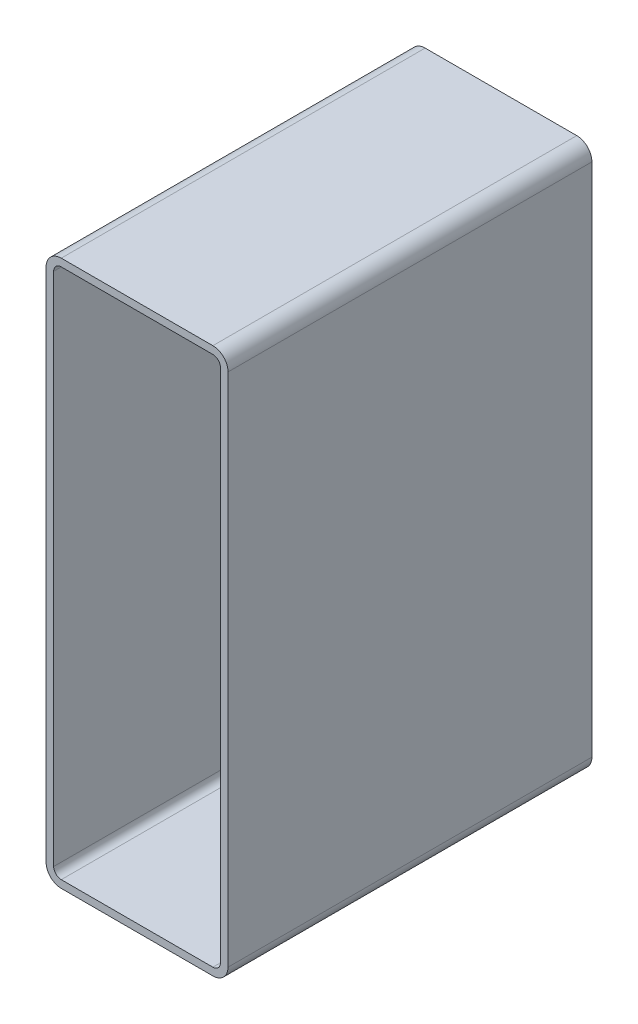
ISO-10303-21;
HEADER;
FILE_DESCRIPTION(('STEP AP214'),'2;1');
FILE_NAME('part.step','',(''),(''),'','','');
FILE_SCHEMA(('AUTOMOTIVE_DESIGN { 1 0 10303 214 1 1 1 1 }'));
ENDSEC;
DATA;
#1=APPLICATION_CONTEXT('core data for automotive mechanical design processes');
#2=APPLICATION_PROTOCOL_DEFINITION('international standard','automotive_design',2000,#1);
#3=PRODUCT_CONTEXT('',#1,'mechanical');
#4=PRODUCT('Part','Part','',(#3));
#5=PRODUCT_RELATED_PRODUCT_CATEGORY('part','',(#4));
#6=PRODUCT_DEFINITION_FORMATION('','',#4);
#7=PRODUCT_DEFINITION_CONTEXT('part definition',#1,'design');
#8=PRODUCT_DEFINITION('design','',#6,#7);
#9=PRODUCT_DEFINITION_SHAPE('','',#8);
#10=(LENGTH_UNIT() NAMED_UNIT(*) SI_UNIT(.MILLI.,.METRE.));
#11=(NAMED_UNIT(*) PLANE_ANGLE_UNIT() SI_UNIT($,.RADIAN.));
#12=(NAMED_UNIT(*) SI_UNIT($,.STERADIAN.) SOLID_ANGLE_UNIT());
#13=UNCERTAINTY_MEASURE_WITH_UNIT(LENGTH_MEASURE(1.E-05),#10,'distance_accuracy_value','');
#14=(GEOMETRIC_REPRESENTATION_CONTEXT(3) GLOBAL_UNCERTAINTY_ASSIGNED_CONTEXT((#13)) GLOBAL_UNIT_ASSIGNED_CONTEXT((#10,
#11,#12)) REPRESENTATION_CONTEXT('',''));
#15=CARTESIAN_POINT('',(0.,0.,0.));
#16=DIRECTION('',(0.,0.,1.));
#17=DIRECTION('',(1.,0.,0.));
#18=AXIS2_PLACEMENT_3D('',#15,#16,#17);
#19=CARTESIAN_POINT('',(139.747301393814,14.4370453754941,304.8));
#20=DIRECTION('',(0.,0.,1.));
#21=DIRECTION('',(1.,0.,0.));
#22=AXIS2_PLACEMENT_3D('',#19,#20,#21);
#23=PLANE('',#22);
#24=CARTESIAN_POINT('',(139.747301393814,14.4370453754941,304.8));
#25=DIRECTION('',(0.,0.,1.));
#26=DIRECTION('',(1.,0.,0.));
#27=AXIS2_PLACEMENT_3D('',#24,#25,#26);
#28=CIRCLE('',#27,12.7);
#29=CARTESIAN_POINT('',(139.747301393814,1.73704537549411,304.8));
#30=VERTEX_POINT('',#29);
#31=CARTESIAN_POINT('',(152.447301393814,14.4370453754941,304.8));
#32=VERTEX_POINT('',#31);
#33=EDGE_CURVE('E211',#30,#32,#28,.T.);
#34=ORIENTED_EDGE('',*,*,#33,.T.);
#35=DIRECTION('',(0.,1.,0.));
#36=VECTOR('',#35,1.);
#37=CARTESIAN_POINT('',(152.447301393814,446.237045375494,304.8));
#38=LINE('',#37,#36);
#39=CARTESIAN_POINT('',(152.447301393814,446.237045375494,304.8));
#40=VERTEX_POINT('',#39);
#41=EDGE_CURVE('E214',#32,#40,#38,.T.);
#42=ORIENTED_EDGE('',*,*,#41,.T.);
#43=CARTESIAN_POINT('',(139.747301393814,446.237045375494,304.8));
#44=DIRECTION('',(0.,0.,1.));
#45=DIRECTION('',(1.,0.,0.));
#46=AXIS2_PLACEMENT_3D('',#43,#44,#45);
#47=CIRCLE('',#46,12.7);
#48=CARTESIAN_POINT('',(139.747301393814,458.937045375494,304.8));
#49=VERTEX_POINT('',#48);
#50=EDGE_CURVE('E217',#40,#49,#47,.T.);
#51=ORIENTED_EDGE('',*,*,#50,.T.);
#52=DIRECTION('',(-1.,0.,0.));
#53=VECTOR('',#52,1.);
#54=CARTESIAN_POINT('',(12.7473013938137,458.937045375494,304.8));
#55=LINE('',#54,#53);
#56=CARTESIAN_POINT('',(12.7473013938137,458.937045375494,304.8));
#57=VERTEX_POINT('',#56);
#58=EDGE_CURVE('E219',#49,#57,#55,.T.);
#59=ORIENTED_EDGE('',*,*,#58,.T.);
#60=CARTESIAN_POINT('',(12.7473013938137,446.237045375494,304.8));
#61=DIRECTION('',(0.,0.,1.));
#62=DIRECTION('',(1.,0.,0.));
#63=AXIS2_PLACEMENT_3D('',#60,#61,#62);
#64=CIRCLE('',#63,12.7);
#65=CARTESIAN_POINT('',(0.0473013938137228,446.237045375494,304.8));
#66=VERTEX_POINT('',#65);
#67=EDGE_CURVE('E221',#57,#66,#64,.T.);
#68=ORIENTED_EDGE('',*,*,#67,.T.);
#69=DIRECTION('',(0.,-1.,0.));
#70=VECTOR('',#69,1.);
#71=CARTESIAN_POINT('',(0.0473013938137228,14.4370453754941,304.8));
#72=LINE('',#71,#70);
#73=CARTESIAN_POINT('',(0.0473013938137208,14.4370453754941,304.8));
#74=VERTEX_POINT('',#73);
#75=EDGE_CURVE('E223',#66,#74,#72,.T.);
#76=ORIENTED_EDGE('',*,*,#75,.T.);
#77=CARTESIAN_POINT('',(12.7473013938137,14.4370453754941,304.8));
#78=DIRECTION('',(0.,0.,1.));
#79=DIRECTION('',(1.,0.,0.));
#80=AXIS2_PLACEMENT_3D('',#77,#78,#79);
#81=CIRCLE('',#80,12.7);
#82=CARTESIAN_POINT('',(12.7473013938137,1.73704537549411,304.8));
#83=VERTEX_POINT('',#82);
#84=EDGE_CURVE('E225',#74,#83,#81,.T.);
#85=ORIENTED_EDGE('',*,*,#84,.T.);
#86=DIRECTION('',(1.,0.,0.));
#87=VECTOR('',#86,1.);
#88=CARTESIAN_POINT('',(139.747301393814,1.73704537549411,304.8));
#89=LINE('',#88,#87);
#90=EDGE_CURVE('E227',#83,#30,#89,.T.);
#91=ORIENTED_EDGE('',*,*,#90,.T.);
#92=EDGE_LOOP('',(#34,#42,#51,#59,#68,#76,#85,#91));
#93=FACE_BOUND('',#92,.T.);
#94=DIRECTION('',(0.,-1.,0.));
#95=VECTOR('',#94,1.);
#96=CARTESIAN_POINT('',(6.39730139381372,14.4370453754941,304.8));
#97=LINE('',#96,#95);
#98=CARTESIAN_POINT('',(6.39730139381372,446.237045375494,304.8));
#99=VERTEX_POINT('',#98);
#100=CARTESIAN_POINT('',(6.39730139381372,14.4370453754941,304.8));
#101=VERTEX_POINT('',#100);
#102=EDGE_CURVE('E154',#99,#101,#97,.T.);
#103=ORIENTED_EDGE('',*,*,#102,.F.);
#104=CARTESIAN_POINT('',(12.7473013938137,446.237045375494,304.8));
#105=DIRECTION('',(0.,0.,1.));
#106=DIRECTION('',(1.,0.,0.));
#107=AXIS2_PLACEMENT_3D('',#104,#105,#106);
#108=CIRCLE('',#107,6.35000000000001);
#109=CARTESIAN_POINT('',(12.7473013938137,452.587045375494,304.8));
#110=VERTEX_POINT('',#109);
#111=EDGE_CURVE('E146',#110,#99,#108,.T.);
#112=ORIENTED_EDGE('',*,*,#111,.F.);
#113=DIRECTION('',(-1.,0.,0.));
#114=VECTOR('',#113,1.);
#115=CARTESIAN_POINT('',(12.7473013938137,452.587045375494,304.8));
#116=LINE('',#115,#114);
#117=CARTESIAN_POINT('',(139.747301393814,452.587045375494,304.8));
#118=VERTEX_POINT('',#117);
#119=EDGE_CURVE('E179',#118,#110,#116,.T.);
#120=ORIENTED_EDGE('',*,*,#119,.F.);
#121=CARTESIAN_POINT('',(139.747301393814,446.237045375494,304.8));
#122=DIRECTION('',(0.,0.,1.));
#123=DIRECTION('',(1.,0.,0.));
#124=AXIS2_PLACEMENT_3D('',#121,#122,#123);
#125=CIRCLE('',#124,6.35000000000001);
#126=CARTESIAN_POINT('',(146.097301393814,446.237045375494,304.8));
#127=VERTEX_POINT('',#126);
#128=EDGE_CURVE('E177',#127,#118,#125,.T.);
#129=ORIENTED_EDGE('',*,*,#128,.F.);
#130=DIRECTION('',(0.,1.,0.));
#131=VECTOR('',#130,1.);
#132=CARTESIAN_POINT('',(146.097301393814,446.237045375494,304.8));
#133=LINE('',#132,#131);
#134=CARTESIAN_POINT('',(146.097301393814,14.4370453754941,304.8));
#135=VERTEX_POINT('',#134);
#136=EDGE_CURVE('E175',#135,#127,#133,.T.);
#137=ORIENTED_EDGE('',*,*,#136,.F.);
#138=CARTESIAN_POINT('',(139.747301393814,14.4370453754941,304.8));
#139=DIRECTION('',(0.,0.,1.));
#140=DIRECTION('',(1.,0.,0.));
#141=AXIS2_PLACEMENT_3D('',#138,#139,#140);
#142=CIRCLE('',#141,6.35);
#143=CARTESIAN_POINT('',(139.747301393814,8.08704537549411,304.8));
#144=VERTEX_POINT('',#143);
#145=EDGE_CURVE('E173',#144,#135,#142,.T.);
#146=ORIENTED_EDGE('',*,*,#145,.F.);
#147=DIRECTION('',(1.,0.,0.));
#148=VECTOR('',#147,1.);
#149=CARTESIAN_POINT('',(139.747301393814,8.0870453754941,304.8));
#150=LINE('',#149,#148);
#151=CARTESIAN_POINT('',(12.7473013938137,8.0870453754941,304.8));
#152=VERTEX_POINT('',#151);
#153=EDGE_CURVE('E169',#152,#144,#150,.T.);
#154=ORIENTED_EDGE('',*,*,#153,.F.);
#155=CARTESIAN_POINT('',(12.7473013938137,14.4370453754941,304.8));
#156=DIRECTION('',(0.,0.,1.));
#157=DIRECTION('',(1.,0.,0.));
#158=AXIS2_PLACEMENT_3D('',#155,#156,#157);
#159=CIRCLE('',#158,6.35);
#160=EDGE_CURVE('E167',#101,#152,#159,.T.);
#161=ORIENTED_EDGE('',*,*,#160,.F.);
#162=EDGE_LOOP('',(#103,#112,#120,#129,#137,#146,#154,#161));
#163=FACE_BOUND('',#162,.T.);
#164=ADVANCED_FACE('F33',(#93,#163),#23,.T.);
#165=CARTESIAN_POINT('',(139.747301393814,14.4370453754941,0.));
#166=DIRECTION('',(0.,0.,1.));
#167=DIRECTION('',(1.,0.,0.));
#168=AXIS2_PLACEMENT_3D('',#165,#166,#167);
#169=PLANE('',#168);
#170=CARTESIAN_POINT('',(139.747301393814,14.4370453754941,0.));
#171=DIRECTION('',(0.,0.,1.));
#172=DIRECTION('',(1.,0.,0.));
#173=AXIS2_PLACEMENT_3D('',#170,#171,#172);
#174=CIRCLE('',#173,12.7);
#175=CARTESIAN_POINT('',(139.747301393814,1.73704537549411,0.));
#176=VERTEX_POINT('',#175);
#177=CARTESIAN_POINT('',(152.447301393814,14.4370453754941,0.));
#178=VERTEX_POINT('',#177);
#179=EDGE_CURVE('E162',#176,#178,#174,.T.);
#180=ORIENTED_EDGE('',*,*,#179,.F.);
#181=DIRECTION('',(1.,0.,0.));
#182=VECTOR('',#181,1.);
#183=CARTESIAN_POINT('',(139.747301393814,1.73704537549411,0.));
#184=LINE('',#183,#182);
#185=CARTESIAN_POINT('',(12.7473013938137,1.73704537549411,0.));
#186=VERTEX_POINT('',#185);
#187=EDGE_CURVE('E215',#186,#176,#184,.T.);
#188=ORIENTED_EDGE('',*,*,#187,.F.);
#189=CARTESIAN_POINT('',(12.7473013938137,14.4370453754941,0.));
#190=DIRECTION('',(0.,0.,1.));
#191=DIRECTION('',(1.,0.,0.));
#192=AXIS2_PLACEMENT_3D('',#189,#190,#191);
#193=CIRCLE('',#192,12.7);
#194=CARTESIAN_POINT('',(0.0473013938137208,14.4370453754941,0.));
#195=VERTEX_POINT('',#194);
#196=EDGE_CURVE('E242',#195,#186,#193,.T.);
#197=ORIENTED_EDGE('',*,*,#196,.F.);
#198=DIRECTION('',(0.,-1.,0.));
#199=VECTOR('',#198,1.);
#200=CARTESIAN_POINT('',(0.0473013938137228,14.4370453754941,0.));
#201=LINE('',#200,#199);
#202=CARTESIAN_POINT('',(0.0473013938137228,446.237045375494,0.));
#203=VERTEX_POINT('',#202);
#204=EDGE_CURVE('E240',#203,#195,#201,.T.);
#205=ORIENTED_EDGE('',*,*,#204,.F.);
#206=CARTESIAN_POINT('',(12.7473013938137,446.237045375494,0.));
#207=DIRECTION('',(0.,0.,1.));
#208=DIRECTION('',(1.,0.,0.));
#209=AXIS2_PLACEMENT_3D('',#206,#207,#208);
#210=CIRCLE('',#209,12.7);
#211=CARTESIAN_POINT('',(12.7473013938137,458.937045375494,0.));
#212=VERTEX_POINT('',#211);
#213=EDGE_CURVE('E238',#212,#203,#210,.T.);
#214=ORIENTED_EDGE('',*,*,#213,.F.);
#215=DIRECTION('',(-1.,0.,0.));
#216=VECTOR('',#215,1.);
#217=CARTESIAN_POINT('',(12.7473013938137,458.937045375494,0.));
#218=LINE('',#217,#216);
#219=CARTESIAN_POINT('',(139.747301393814,458.937045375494,0.));
#220=VERTEX_POINT('',#219);
#221=EDGE_CURVE('E236',#220,#212,#218,.T.);
#222=ORIENTED_EDGE('',*,*,#221,.F.);
#223=CARTESIAN_POINT('',(139.747301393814,446.237045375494,0.));
#224=DIRECTION('',(0.,0.,1.));
#225=DIRECTION('',(1.,0.,0.));
#226=AXIS2_PLACEMENT_3D('',#223,#224,#225);
#227=CIRCLE('',#226,12.7);
#228=CARTESIAN_POINT('',(152.447301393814,446.237045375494,0.));
#229=VERTEX_POINT('',#228);
#230=EDGE_CURVE('E234',#229,#220,#227,.T.);
#231=ORIENTED_EDGE('',*,*,#230,.F.);
#232=DIRECTION('',(0.,1.,0.));
#233=VECTOR('',#232,1.);
#234=CARTESIAN_POINT('',(152.447301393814,446.237045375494,0.));
#235=LINE('',#234,#233);
#236=EDGE_CURVE('E232',#178,#229,#235,.T.);
#237=ORIENTED_EDGE('',*,*,#236,.F.);
#238=EDGE_LOOP('',(#180,#188,#197,#205,#214,#222,#231,#237));
#239=FACE_BOUND('',#238,.T.);
#240=CARTESIAN_POINT('',(12.7473013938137,446.237045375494,0.));
#241=DIRECTION('',(0.,0.,1.));
#242=DIRECTION('',(1.,0.,0.));
#243=AXIS2_PLACEMENT_3D('',#240,#241,#242);
#244=CIRCLE('',#243,6.35000000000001);
#245=CARTESIAN_POINT('',(12.7473013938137,452.587045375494,0.));
#246=VERTEX_POINT('',#245);
#247=CARTESIAN_POINT('',(6.39730139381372,446.237045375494,0.));
#248=VERTEX_POINT('',#247);
#249=EDGE_CURVE('E56',#246,#248,#244,.T.);
#250=ORIENTED_EDGE('',*,*,#249,.T.);
#251=DIRECTION('',(0.,-1.,0.));
#252=VECTOR('',#251,1.);
#253=CARTESIAN_POINT('',(6.39730139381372,14.4370453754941,0.));
#254=LINE('',#253,#252);
#255=CARTESIAN_POINT('',(6.39730139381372,14.4370453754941,0.));
#256=VERTEX_POINT('',#255);
#257=EDGE_CURVE('E161',#248,#256,#254,.T.);
#258=ORIENTED_EDGE('',*,*,#257,.T.);
#259=CARTESIAN_POINT('',(12.7473013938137,14.4370453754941,0.));
#260=DIRECTION('',(0.,0.,1.));
#261=DIRECTION('',(1.,0.,0.));
#262=AXIS2_PLACEMENT_3D('',#259,#260,#261);
#263=CIRCLE('',#262,6.35);
#264=CARTESIAN_POINT('',(12.7473013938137,8.0870453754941,0.));
#265=VERTEX_POINT('',#264);
#266=EDGE_CURVE('E183',#256,#265,#263,.T.);
#267=ORIENTED_EDGE('',*,*,#266,.T.);
#268=DIRECTION('',(1.,0.,0.));
#269=VECTOR('',#268,1.);
#270=CARTESIAN_POINT('',(139.747301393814,8.0870453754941,0.));
#271=LINE('',#270,#269);
#272=CARTESIAN_POINT('',(139.747301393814,8.08704537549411,0.));
#273=VERTEX_POINT('',#272);
#274=EDGE_CURVE('E186',#265,#273,#271,.T.);
#275=ORIENTED_EDGE('',*,*,#274,.T.);
#276=CARTESIAN_POINT('',(139.747301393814,14.4370453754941,0.));
#277=DIRECTION('',(0.,0.,1.));
#278=DIRECTION('',(1.,0.,0.));
#279=AXIS2_PLACEMENT_3D('',#276,#277,#278);
#280=CIRCLE('',#279,6.35);
#281=CARTESIAN_POINT('',(146.097301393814,14.4370453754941,0.));
#282=VERTEX_POINT('',#281);
#283=EDGE_CURVE('E189',#273,#282,#280,.T.);
#284=ORIENTED_EDGE('',*,*,#283,.T.);
#285=DIRECTION('',(0.,1.,0.));
#286=VECTOR('',#285,1.);
#287=CARTESIAN_POINT('',(146.097301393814,446.237045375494,0.));
#288=LINE('',#287,#286);
#289=CARTESIAN_POINT('',(146.097301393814,446.237045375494,0.));
#290=VERTEX_POINT('',#289);
#291=EDGE_CURVE('E192',#282,#290,#288,.T.);
#292=ORIENTED_EDGE('',*,*,#291,.T.);
#293=CARTESIAN_POINT('',(139.747301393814,446.237045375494,0.));
#294=DIRECTION('',(0.,0.,1.));
#295=DIRECTION('',(1.,0.,0.));
#296=AXIS2_PLACEMENT_3D('',#293,#294,#295);
#297=CIRCLE('',#296,6.35000000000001);
#298=CARTESIAN_POINT('',(139.747301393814,452.587045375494,0.));
#299=VERTEX_POINT('',#298);
#300=EDGE_CURVE('E195',#290,#299,#297,.T.);
#301=ORIENTED_EDGE('',*,*,#300,.T.);
#302=DIRECTION('',(-1.,0.,0.));
#303=VECTOR('',#302,1.);
#304=CARTESIAN_POINT('',(12.7473013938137,452.587045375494,0.));
#305=LINE('',#304,#303);
#306=EDGE_CURVE('E155',#299,#246,#305,.T.);
#307=ORIENTED_EDGE('',*,*,#306,.T.);
#308=EDGE_LOOP('',(#250,#258,#267,#275,#284,#292,#301,#307));
#309=FACE_BOUND('',#308,.T.);
#310=ADVANCED_FACE('F272',(#239,#309),#169,.F.);
#311=CARTESIAN_POINT('',(139.747301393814,14.4370453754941,304.8));
#312=DIRECTION('',(0.,0.,-1.));
#313=DIRECTION('',(-1.,0.,0.));
#314=AXIS2_PLACEMENT_3D('',#311,#312,#313);
#315=CYLINDRICAL_SURFACE('',#314,12.7);
#316=ORIENTED_EDGE('',*,*,#179,.T.);
#317=DIRECTION('',(0.,0.,-1.));
#318=VECTOR('',#317,1.);
#319=CARTESIAN_POINT('',(152.447301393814,14.4370453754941,304.8));
#320=LINE('',#319,#318);
#321=EDGE_CURVE('E11',#32,#178,#320,.T.);
#322=ORIENTED_EDGE('',*,*,#321,.F.);
#323=ORIENTED_EDGE('',*,*,#33,.F.);
#324=DIRECTION('',(0.,0.,-1.));
#325=VECTOR('',#324,1.);
#326=CARTESIAN_POINT('',(139.747301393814,1.73704537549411,304.8));
#327=LINE('',#326,#325);
#328=EDGE_CURVE('E229',#30,#176,#327,.T.);
#329=ORIENTED_EDGE('',*,*,#328,.T.);
#330=EDGE_LOOP('',(#316,#322,#323,#329));
#331=FACE_BOUND('',#330,.T.);
#332=ADVANCED_FACE('F35',(#331),#315,.T.);
#333=CARTESIAN_POINT('',(152.447301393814,446.237045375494,304.8));
#334=DIRECTION('',(-1.,0.,0.));
#335=DIRECTION('',(0.,0.,1.));
#336=AXIS2_PLACEMENT_3D('',#333,#334,#335);
#337=PLANE('',#336);
#338=ORIENTED_EDGE('',*,*,#236,.T.);
#339=DIRECTION('',(0.,0.,-1.));
#340=VECTOR('',#339,1.);
#341=CARTESIAN_POINT('',(152.447301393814,446.237045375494,304.8));
#342=LINE('',#341,#340);
#343=EDGE_CURVE('E41',#40,#229,#342,.T.);
#344=ORIENTED_EDGE('',*,*,#343,.F.);
#345=ORIENTED_EDGE('',*,*,#41,.F.);
#346=ORIENTED_EDGE('',*,*,#321,.T.);
#347=EDGE_LOOP('',(#338,#344,#345,#346));
#348=FACE_BOUND('',#347,.T.);
#349=ADVANCED_FACE('F289',(#348),#337,.F.);
#350=CARTESIAN_POINT('',(139.747301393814,446.237045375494,304.8));
#351=DIRECTION('',(0.,0.,-1.));
#352=DIRECTION('',(-1.,0.,0.));
#353=AXIS2_PLACEMENT_3D('',#350,#351,#352);
#354=CYLINDRICAL_SURFACE('',#353,12.7);
#355=ORIENTED_EDGE('',*,*,#230,.T.);
#356=DIRECTION('',(0.,0.,-1.));
#357=VECTOR('',#356,1.);
#358=CARTESIAN_POINT('',(139.747301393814,458.937045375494,304.8));
#359=LINE('',#358,#357);
#360=EDGE_CURVE('E259',#49,#220,#359,.T.);
#361=ORIENTED_EDGE('',*,*,#360,.F.);
#362=ORIENTED_EDGE('',*,*,#50,.F.);
#363=ORIENTED_EDGE('',*,*,#343,.T.);
#364=EDGE_LOOP('',(#355,#361,#362,#363));
#365=FACE_BOUND('',#364,.T.);
#366=ADVANCED_FACE('F266',(#365),#354,.T.);
#367=CARTESIAN_POINT('',(12.7473013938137,458.937045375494,304.8));
#368=DIRECTION('',(0.,-1.,0.));
#369=DIRECTION('',(0.,0.,-1.));
#370=AXIS2_PLACEMENT_3D('',#367,#368,#369);
#371=PLANE('',#370);
#372=ORIENTED_EDGE('',*,*,#221,.T.);
#373=DIRECTION('',(0.,0.,-1.));
#374=VECTOR('',#373,1.);
#375=CARTESIAN_POINT('',(12.7473013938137,458.937045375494,304.8));
#376=LINE('',#375,#374);
#377=EDGE_CURVE('E256',#57,#212,#376,.T.);
#378=ORIENTED_EDGE('',*,*,#377,.F.);
#379=ORIENTED_EDGE('',*,*,#58,.F.);
#380=ORIENTED_EDGE('',*,*,#360,.T.);
#381=EDGE_LOOP('',(#372,#378,#379,#380));
#382=FACE_BOUND('',#381,.T.);
#383=ADVANCED_FACE('F278',(#382),#371,.F.);
#384=CARTESIAN_POINT('',(12.7473013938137,446.237045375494,304.8));
#385=DIRECTION('',(0.,0.,-1.));
#386=DIRECTION('',(-1.,0.,0.));
#387=AXIS2_PLACEMENT_3D('',#384,#385,#386);
#388=CYLINDRICAL_SURFACE('',#387,12.7);
#389=ORIENTED_EDGE('',*,*,#213,.T.);
#390=DIRECTION('',(0.,0.,-1.));
#391=VECTOR('',#390,1.);
#392=CARTESIAN_POINT('',(0.0473013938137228,446.237045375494,304.8));
#393=LINE('',#392,#391);
#394=EDGE_CURVE('E253',#66,#203,#393,.T.);
#395=ORIENTED_EDGE('',*,*,#394,.F.);
#396=ORIENTED_EDGE('',*,*,#67,.F.);
#397=ORIENTED_EDGE('',*,*,#377,.T.);
#398=EDGE_LOOP('',(#389,#395,#396,#397));
#399=FACE_BOUND('',#398,.T.);
#400=ADVANCED_FACE('F282',(#399),#388,.T.);
#401=CARTESIAN_POINT('',(0.0473013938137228,14.4370453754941,304.8));
#402=DIRECTION('',(1.,0.,0.));
#403=DIRECTION('',(0.,0.,-1.));
#404=AXIS2_PLACEMENT_3D('',#401,#402,#403);
#405=PLANE('',#404);
#406=ORIENTED_EDGE('',*,*,#204,.T.);
#407=DIRECTION('',(0.,0.,-1.));
#408=VECTOR('',#407,1.);
#409=CARTESIAN_POINT('',(0.0473013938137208,14.4370453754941,304.8));
#410=LINE('',#409,#408);
#411=EDGE_CURVE('E250',#74,#195,#410,.T.);
#412=ORIENTED_EDGE('',*,*,#411,.F.);
#413=ORIENTED_EDGE('',*,*,#75,.F.);
#414=ORIENTED_EDGE('',*,*,#394,.T.);
#415=EDGE_LOOP('',(#406,#412,#413,#414));
#416=FACE_BOUND('',#415,.T.);
#417=ADVANCED_FACE('F302',(#416),#405,.F.);
#418=CARTESIAN_POINT('',(12.7473013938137,14.4370453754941,304.8));
#419=DIRECTION('',(0.,0.,-1.));
#420=DIRECTION('',(-1.,0.,0.));
#421=AXIS2_PLACEMENT_3D('',#418,#419,#420);
#422=CYLINDRICAL_SURFACE('',#421,12.7);
#423=ORIENTED_EDGE('',*,*,#196,.T.);
#424=DIRECTION('',(0.,0.,-1.));
#425=VECTOR('',#424,1.);
#426=CARTESIAN_POINT('',(12.7473013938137,1.73704537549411,304.8));
#427=LINE('',#426,#425);
#428=EDGE_CURVE('E247',#83,#186,#427,.T.);
#429=ORIENTED_EDGE('',*,*,#428,.F.);
#430=ORIENTED_EDGE('',*,*,#84,.F.);
#431=ORIENTED_EDGE('',*,*,#411,.T.);
#432=EDGE_LOOP('',(#423,#429,#430,#431));
#433=FACE_BOUND('',#432,.T.);
#434=ADVANCED_FACE('F300',(#433),#422,.T.);
#435=CARTESIAN_POINT('',(139.747301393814,1.73704537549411,304.8));
#436=DIRECTION('',(0.,1.,0.));
#437=DIRECTION('',(0.,0.,1.));
#438=AXIS2_PLACEMENT_3D('',#435,#436,#437);
#439=PLANE('',#438);
#440=ORIENTED_EDGE('',*,*,#187,.T.);
#441=ORIENTED_EDGE('',*,*,#328,.F.);
#442=ORIENTED_EDGE('',*,*,#90,.F.);
#443=ORIENTED_EDGE('',*,*,#428,.T.);
#444=EDGE_LOOP('',(#440,#441,#442,#443));
#445=FACE_BOUND('',#444,.T.);
#446=ADVANCED_FACE('F295',(#445),#439,.F.);
#447=CARTESIAN_POINT('',(12.7473013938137,446.237045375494,304.8));
#448=DIRECTION('',(0.,0.,-1.));
#449=DIRECTION('',(-1.,0.,0.));
#450=AXIS2_PLACEMENT_3D('',#447,#448,#449);
#451=CYLINDRICAL_SURFACE('',#450,6.35000000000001);
#452=ORIENTED_EDGE('',*,*,#249,.F.);
#453=DIRECTION('',(0.,0.,-1.));
#454=VECTOR('',#453,1.);
#455=CARTESIAN_POINT('',(12.7473013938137,452.587045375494,304.8));
#456=LINE('',#455,#454);
#457=EDGE_CURVE('E150',#110,#246,#456,.T.);
#458=ORIENTED_EDGE('',*,*,#457,.F.);
#459=ORIENTED_EDGE('',*,*,#111,.T.);
#460=DIRECTION('',(0.,0.,-1.));
#461=VECTOR('',#460,1.);
#462=CARTESIAN_POINT('',(6.39730139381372,446.237045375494,304.8));
#463=LINE('',#462,#461);
#464=EDGE_CURVE('E149',#99,#248,#463,.T.);
#465=ORIENTED_EDGE('',*,*,#464,.T.);
#466=EDGE_LOOP('',(#452,#458,#459,#465));
#467=FACE_BOUND('',#466,.T.);
#468=ADVANCED_FACE('F148',(#467),#451,.F.);
#469=CARTESIAN_POINT('',(6.39730139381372,14.4370453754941,304.8));
#470=DIRECTION('',(1.,0.,0.));
#471=DIRECTION('',(0.,0.,-1.));
#472=AXIS2_PLACEMENT_3D('',#469,#470,#471);
#473=PLANE('',#472);
#474=ORIENTED_EDGE('',*,*,#257,.F.);
#475=ORIENTED_EDGE('',*,*,#464,.F.);
#476=ORIENTED_EDGE('',*,*,#102,.T.);
#477=DIRECTION('',(0.,0.,-1.));
#478=VECTOR('',#477,1.);
#479=CARTESIAN_POINT('',(6.39730139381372,14.4370453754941,304.8));
#480=LINE('',#479,#478);
#481=EDGE_CURVE('E163',#101,#256,#480,.T.);
#482=ORIENTED_EDGE('',*,*,#481,.T.);
#483=EDGE_LOOP('',(#474,#475,#476,#482));
#484=FACE_BOUND('',#483,.T.);
#485=ADVANCED_FACE('F158',(#484),#473,.T.);
#486=CARTESIAN_POINT('',(12.7473013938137,14.4370453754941,304.8));
#487=DIRECTION('',(0.,0.,-1.));
#488=DIRECTION('',(-1.,0.,0.));
#489=AXIS2_PLACEMENT_3D('',#486,#487,#488);
#490=CYLINDRICAL_SURFACE('',#489,6.35);
#491=ORIENTED_EDGE('',*,*,#266,.F.);
#492=ORIENTED_EDGE('',*,*,#481,.F.);
#493=ORIENTED_EDGE('',*,*,#160,.T.);
#494=DIRECTION('',(0.,0.,-1.));
#495=VECTOR('',#494,1.);
#496=CARTESIAN_POINT('',(12.7473013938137,8.0870453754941,304.8));
#497=LINE('',#496,#495);
#498=EDGE_CURVE('E208',#152,#265,#497,.T.);
#499=ORIENTED_EDGE('',*,*,#498,.T.);
#500=EDGE_LOOP('',(#491,#492,#493,#499));
#501=FACE_BOUND('',#500,.T.);
#502=ADVANCED_FACE('F327',(#501),#490,.F.);
#503=CARTESIAN_POINT('',(139.747301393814,8.0870453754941,304.8));
#504=DIRECTION('',(0.,1.,0.));
#505=DIRECTION('',(0.,0.,1.));
#506=AXIS2_PLACEMENT_3D('',#503,#504,#505);
#507=PLANE('',#506);
#508=ORIENTED_EDGE('',*,*,#274,.F.);
#509=ORIENTED_EDGE('',*,*,#498,.F.);
#510=ORIENTED_EDGE('',*,*,#153,.T.);
#511=DIRECTION('',(0.,0.,-1.));
#512=VECTOR('',#511,1.);
#513=CARTESIAN_POINT('',(139.747301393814,8.08704537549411,304.8));
#514=LINE('',#513,#512);
#515=EDGE_CURVE('E206',#144,#273,#514,.T.);
#516=ORIENTED_EDGE('',*,*,#515,.T.);
#517=EDGE_LOOP('',(#508,#509,#510,#516));
#518=FACE_BOUND('',#517,.T.);
#519=ADVANCED_FACE('F331',(#518),#507,.T.);
#520=CARTESIAN_POINT('',(139.747301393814,14.4370453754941,304.8));
#521=DIRECTION('',(0.,0.,-1.));
#522=DIRECTION('',(-1.,0.,0.));
#523=AXIS2_PLACEMENT_3D('',#520,#521,#522);
#524=CYLINDRICAL_SURFACE('',#523,6.35);
#525=ORIENTED_EDGE('',*,*,#283,.F.);
#526=ORIENTED_EDGE('',*,*,#515,.F.);
#527=ORIENTED_EDGE('',*,*,#145,.T.);
#528=DIRECTION('',(0.,0.,-1.));
#529=VECTOR('',#528,1.);
#530=CARTESIAN_POINT('',(146.097301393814,14.4370453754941,304.8));
#531=LINE('',#530,#529);
#532=EDGE_CURVE('E204',#135,#282,#531,.T.);
#533=ORIENTED_EDGE('',*,*,#532,.T.);
#534=EDGE_LOOP('',(#525,#526,#527,#533));
#535=FACE_BOUND('',#534,.T.);
#536=ADVANCED_FACE('F337',(#535),#524,.F.);
#537=CARTESIAN_POINT('',(146.097301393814,446.237045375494,304.8));
#538=DIRECTION('',(-1.,0.,0.));
#539=DIRECTION('',(0.,0.,1.));
#540=AXIS2_PLACEMENT_3D('',#537,#538,#539);
#541=PLANE('',#540);
#542=ORIENTED_EDGE('',*,*,#291,.F.);
#543=ORIENTED_EDGE('',*,*,#532,.F.);
#544=ORIENTED_EDGE('',*,*,#136,.T.);
#545=DIRECTION('',(0.,0.,-1.));
#546=VECTOR('',#545,1.);
#547=CARTESIAN_POINT('',(146.097301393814,446.237045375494,304.8));
#548=LINE('',#547,#546);
#549=EDGE_CURVE('E202',#127,#290,#548,.T.);
#550=ORIENTED_EDGE('',*,*,#549,.T.);
#551=EDGE_LOOP('',(#542,#543,#544,#550));
#552=FACE_BOUND('',#551,.T.);
#553=ADVANCED_FACE('F341',(#552),#541,.T.);
#554=CARTESIAN_POINT('',(139.747301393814,446.237045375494,304.8));
#555=DIRECTION('',(0.,0.,-1.));
#556=DIRECTION('',(-1.,0.,0.));
#557=AXIS2_PLACEMENT_3D('',#554,#555,#556);
#558=CYLINDRICAL_SURFACE('',#557,6.35000000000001);
#559=ORIENTED_EDGE('',*,*,#300,.F.);
#560=ORIENTED_EDGE('',*,*,#549,.F.);
#561=ORIENTED_EDGE('',*,*,#128,.T.);
#562=DIRECTION('',(0.,0.,-1.));
#563=VECTOR('',#562,1.);
#564=CARTESIAN_POINT('',(139.747301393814,452.587045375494,304.8));
#565=LINE('',#564,#563);
#566=EDGE_CURVE('E48',#118,#299,#565,.T.);
#567=ORIENTED_EDGE('',*,*,#566,.T.);
#568=EDGE_LOOP('',(#559,#560,#561,#567));
#569=FACE_BOUND('',#568,.T.);
#570=ADVANCED_FACE('F345',(#569),#558,.F.);
#571=CARTESIAN_POINT('',(12.7473013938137,452.587045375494,304.8));
#572=DIRECTION('',(0.,-1.,0.));
#573=DIRECTION('',(0.,0.,-1.));
#574=AXIS2_PLACEMENT_3D('',#571,#572,#573);
#575=PLANE('',#574);
#576=ORIENTED_EDGE('',*,*,#306,.F.);
#577=ORIENTED_EDGE('',*,*,#566,.F.);
#578=ORIENTED_EDGE('',*,*,#119,.T.);
#579=ORIENTED_EDGE('',*,*,#457,.T.);
#580=EDGE_LOOP('',(#576,#577,#578,#579));
#581=FACE_BOUND('',#580,.T.);
#582=ADVANCED_FACE('F349',(#581),#575,.T.);
#583=CLOSED_SHELL('',(#164,#310,#332,#349,#366,#383,#400,#417,#434,#446,#468,#485,#502,#519,
#536,#553,#570,#582));
#584=MANIFOLD_SOLID_BREP('B2',#583);
#585=ADVANCED_BREP_SHAPE_REPRESENTATION('',(#18,#584),#14);
#586=SHAPE_DEFINITION_REPRESENTATION(#9,#585);
ENDSEC;
END-ISO-10303-21;
